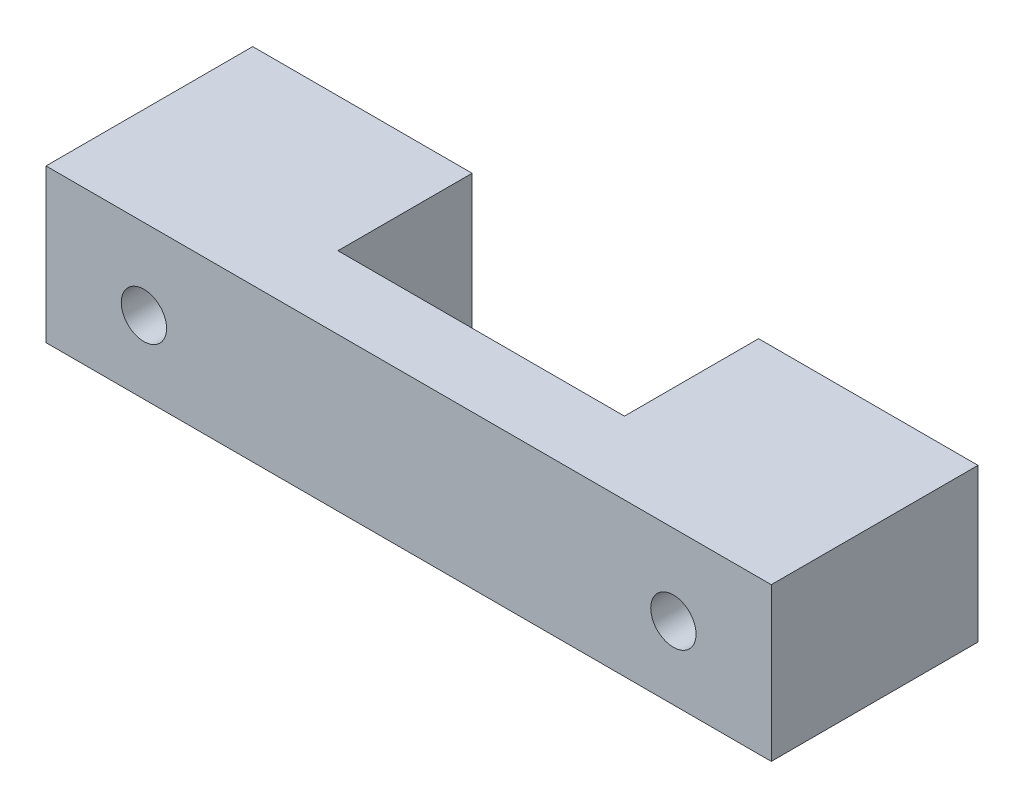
from build123d import *

# Parameters (mm, degrees)
SKETCH1_W          = 15.367
SKETCH1_H          = 10.721417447
EXTRUDE1_DEPTH     = 9.398
EXTRUDE1_2_DEPTH   = 9.398
SKETCH2_W          = 50.8
SKETCH2_H          = 10.721417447
EXTRUDE2_DEPTH     = 5.08
SKETCH3_R          = 1.5875
CUT_EXTRUDE1_DEPTH = 39.514914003


with BuildPart() as part:
    # Sketch1 → Extrude1 (new body)
    with BuildSketch(Plane.XY):
        with Locations((-17.7165, 19.711708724)):
            Rectangle(SKETCH1_W, SKETCH1_H)
    extrude(amount=EXTRUDE1_DEPTH)



with BuildPart() as body_2:
    # Sketch1 → Extrude1 2 (new body)
    with BuildSketch(Plane.XY):
        with Locations((17.7165, 19.711708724)):
            Rectangle(SKETCH1_W, SKETCH1_H)
    extrude(amount=EXTRUDE1_2_DEPTH)


with BuildPart() as part_1:
    add(part.part)

    add(body_2.part)  # Extrude2 merges body 2
    # Sketch2 → Extrude2 (add)
    with BuildSketch(Plane.XY.offset(9.398)):
        with Locations((0, 19.711708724)):
            Rectangle(SKETCH2_W, SKETCH2_H)
    extrude(amount=EXTRUDE2_DEPTH)

    # Sketch3 → Cut-Extrude1 (cut, through all)
    with BuildSketch(Plane(origin=(0, 0, 0), x_dir=(-1, 0, 0), z_dir=(0, 0, -1))):
        with Locations((-18.54311349, 19.433598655)):
            Circle(SKETCH3_R)
        with Locations((18.54311349, 19.433598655)):
            Circle(SKETCH3_R)
    extrude(amount=-CUT_EXTRUDE1_DEPTH, mode=Mode.SUBTRACT)


solid = part_1.part
